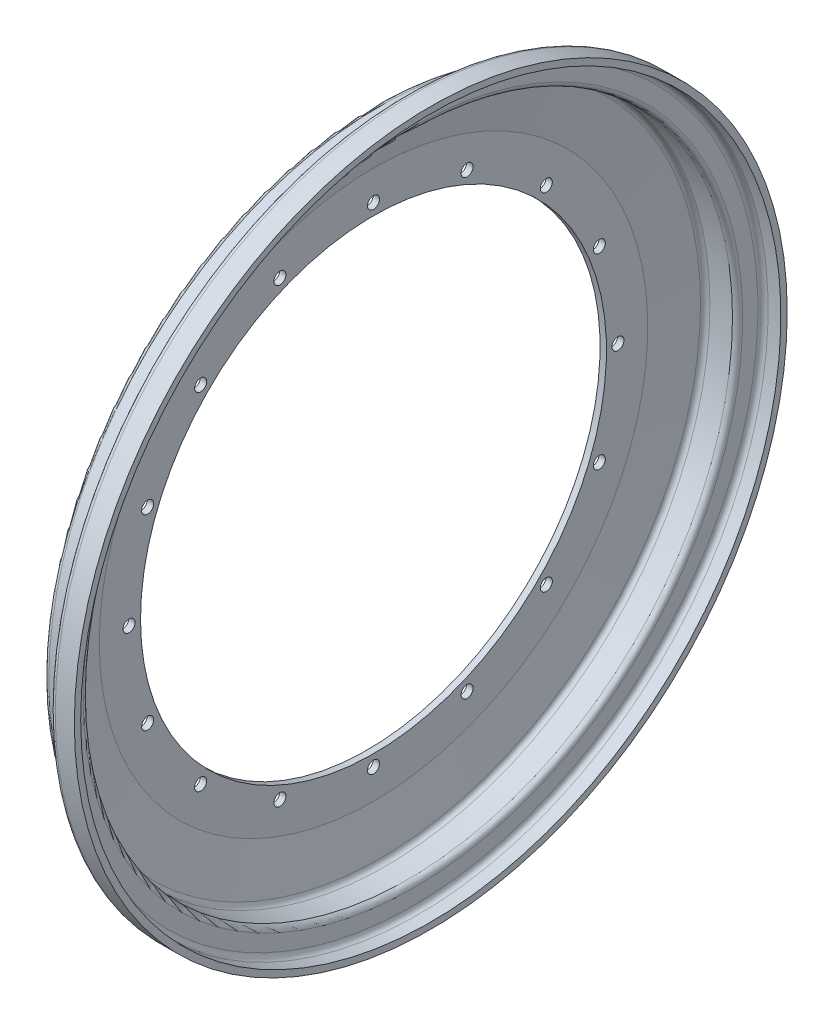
ISO-10303-21;
HEADER;
FILE_DESCRIPTION(('STEP AP214'),'2;1');
FILE_NAME('part.step','',(''),(''),'','','');
FILE_SCHEMA(('AUTOMOTIVE_DESIGN { 1 0 10303 214 1 1 1 1 }'));
ENDSEC;
DATA;
#1=APPLICATION_CONTEXT('core data for automotive mechanical design processes');
#2=APPLICATION_PROTOCOL_DEFINITION('international standard','automotive_design',2000,#1);
#3=PRODUCT_CONTEXT('',#1,'mechanical');
#4=PRODUCT('Part','Part','',(#3));
#5=PRODUCT_RELATED_PRODUCT_CATEGORY('part','',(#4));
#6=PRODUCT_DEFINITION_FORMATION('','',#4);
#7=PRODUCT_DEFINITION_CONTEXT('part definition',#1,'design');
#8=PRODUCT_DEFINITION('design','',#6,#7);
#9=PRODUCT_DEFINITION_SHAPE('','',#8);
#10=(LENGTH_UNIT() NAMED_UNIT(*) SI_UNIT(.MILLI.,.METRE.));
#11=(NAMED_UNIT(*) PLANE_ANGLE_UNIT() SI_UNIT($,.RADIAN.));
#12=(NAMED_UNIT(*) SI_UNIT($,.STERADIAN.) SOLID_ANGLE_UNIT());
#13=UNCERTAINTY_MEASURE_WITH_UNIT(LENGTH_MEASURE(1.E-05),#10,'distance_accuracy_value','');
#14=(GEOMETRIC_REPRESENTATION_CONTEXT(3) GLOBAL_UNCERTAINTY_ASSIGNED_CONTEXT((#13)) GLOBAL_UNIT_ASSIGNED_CONTEXT((#10,
#11,#12)) REPRESENTATION_CONTEXT('',''));
#15=CARTESIAN_POINT('',(0.,0.,0.));
#16=DIRECTION('',(0.,0.,1.));
#17=DIRECTION('',(1.,0.,0.));
#18=AXIS2_PLACEMENT_3D('',#15,#16,#17);
#19=CARTESIAN_POINT('',(3.17499999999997,116.205,0.));
#20=DIRECTION('',(-1.,0.,0.));
#21=DIRECTION('',(0.,0.,1.));
#22=AXIS2_PLACEMENT_3D('',#19,#20,#21);
#23=PLANE('',#22);
#24=CARTESIAN_POINT('',(3.17499999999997,46.656764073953,112.639392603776));
#25=DIRECTION('',(1.,0.,0.));
#26=DIRECTION('',(0.,0.,-1.));
#27=AXIS2_PLACEMENT_3D('',#24,#25,#26);
#28=CIRCLE('',#27,3.);
#29=CARTESIAN_POINT('',(3.17499999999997,46.656764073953,109.639392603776));
#30=VERTEX_POINT('',#29);
#31=EDGE_CURVE('E174',#30,#30,#28,.T.);
#32=ORIENTED_EDGE('',*,*,#31,.F.);
#33=EDGE_LOOP('',(#32));
#34=FACE_BOUND('',#33,.T.);
#35=CARTESIAN_POINT('',(3.17499999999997,-46.6567640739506,112.639392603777));
#36=DIRECTION('',(1.,0.,0.));
#37=DIRECTION('',(0.,0.,-1.));
#38=AXIS2_PLACEMENT_3D('',#35,#36,#37);
#39=CIRCLE('',#38,3.);
#40=CARTESIAN_POINT('',(3.17499999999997,-46.6567640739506,109.639392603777));
#41=VERTEX_POINT('',#40);
#42=EDGE_CURVE('E162',#41,#41,#39,.T.);
#43=ORIENTED_EDGE('',*,*,#42,.F.);
#44=EDGE_LOOP('',(#43));
#45=FACE_BOUND('',#44,.T.);
#46=CARTESIAN_POINT('',(3.17499999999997,-86.2104587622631,86.2104587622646));
#47=DIRECTION('',(1.,0.,0.));
#48=DIRECTION('',(0.,0.,-1.));
#49=AXIS2_PLACEMENT_3D('',#46,#47,#48);
#50=CIRCLE('',#49,3.);
#51=CARTESIAN_POINT('',(3.17499999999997,-86.2104587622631,83.2104587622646));
#52=VERTEX_POINT('',#51);
#53=EDGE_CURVE('E156',#52,#52,#50,.T.);
#54=ORIENTED_EDGE('',*,*,#53,.F.);
#55=EDGE_LOOP('',(#54));
#56=FACE_BOUND('',#55,.T.);
#57=CARTESIAN_POINT('',(3.17499999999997,-112.639392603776,46.6567640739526));
#58=DIRECTION('',(1.,0.,0.));
#59=DIRECTION('',(0.,0.,-1.));
#60=AXIS2_PLACEMENT_3D('',#57,#58,#59);
#61=CIRCLE('',#60,3.);
#62=CARTESIAN_POINT('',(3.17499999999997,-112.639392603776,43.6567640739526));
#63=VERTEX_POINT('',#62);
#64=EDGE_CURVE('E150',#63,#63,#61,.T.);
#65=ORIENTED_EDGE('',*,*,#64,.F.);
#66=EDGE_LOOP('',(#65));
#67=FACE_BOUND('',#66,.T.);
#68=CARTESIAN_POINT('',(3.17499999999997,-121.92,8.51363302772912E-13));
#69=DIRECTION('',(1.,0.,0.));
#70=DIRECTION('',(0.,0.,-1.));
#71=AXIS2_PLACEMENT_3D('',#68,#69,#70);
#72=CIRCLE('',#71,3.);
#73=CARTESIAN_POINT('',(3.17499999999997,-121.92,-2.99999999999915));
#74=VERTEX_POINT('',#73);
#75=EDGE_CURVE('E144',#74,#74,#72,.T.);
#76=ORIENTED_EDGE('',*,*,#75,.F.);
#77=EDGE_LOOP('',(#76));
#78=FACE_BOUND('',#77,.T.);
#79=CARTESIAN_POINT('',(3.17499999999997,-112.639392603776,-46.6567640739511));
#80=DIRECTION('',(1.,0.,0.));
#81=DIRECTION('',(0.,0.,-1.));
#82=AXIS2_PLACEMENT_3D('',#79,#80,#81);
#83=CIRCLE('',#82,3.);
#84=CARTESIAN_POINT('',(3.17499999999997,-112.639392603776,-49.6567640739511));
#85=VERTEX_POINT('',#84);
#86=EDGE_CURVE('E138',#85,#85,#83,.T.);
#87=ORIENTED_EDGE('',*,*,#86,.F.);
#88=EDGE_LOOP('',(#87));
#89=FACE_BOUND('',#88,.T.);
#90=CARTESIAN_POINT('',(3.17499999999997,-86.2104587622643,-86.2104587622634));
#91=DIRECTION('',(1.,0.,0.));
#92=DIRECTION('',(0.,0.,-1.));
#93=AXIS2_PLACEMENT_3D('',#90,#91,#92);
#94=CIRCLE('',#93,3.);
#95=CARTESIAN_POINT('',(3.17499999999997,-86.2104587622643,-89.2104587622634));
#96=VERTEX_POINT('',#95);
#97=EDGE_CURVE('E132',#96,#96,#94,.T.);
#98=ORIENTED_EDGE('',*,*,#97,.F.);
#99=EDGE_LOOP('',(#98));
#100=FACE_BOUND('',#99,.T.);
#101=CARTESIAN_POINT('',(3.17499999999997,0.,0.));
#102=DIRECTION('',(-1.,0.,0.));
#103=DIRECTION('',(0.,0.,1.));
#104=AXIS2_PLACEMENT_3D('',#101,#102,#103);
#105=CIRCLE('',#104,116.205);
#106=CARTESIAN_POINT('',(3.17499999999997,0.,116.205));
#107=VERTEX_POINT('',#106);
#108=EDGE_CURVE('E10',#107,#107,#105,.T.);
#109=ORIENTED_EDGE('',*,*,#108,.T.);
#110=EDGE_LOOP('',(#109));
#111=FACE_BOUND('',#110,.T.);
#112=CARTESIAN_POINT('',(3.17499999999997,0.,0.));
#113=DIRECTION('',(-1.,0.,0.));
#114=DIRECTION('',(0.,0.,1.));
#115=AXIS2_PLACEMENT_3D('',#112,#113,#114);
#116=CIRCLE('',#115,136.779);
#117=CARTESIAN_POINT('',(3.17499999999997,0.,136.779));
#118=VERTEX_POINT('',#117);
#119=EDGE_CURVE('E41',#118,#118,#116,.T.);
#120=ORIENTED_EDGE('',*,*,#119,.F.);
#121=EDGE_LOOP('',(#120));
#122=FACE_BOUND('',#121,.T.);
#123=CARTESIAN_POINT('',(3.17499999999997,121.92,0.));
#124=DIRECTION('',(1.,0.,0.));
#125=DIRECTION('',(0.,0.,-1.));
#126=AXIS2_PLACEMENT_3D('',#123,#124,#125);
#127=CIRCLE('',#126,3.);
#128=CARTESIAN_POINT('',(3.17499999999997,121.92,-3.));
#129=VERTEX_POINT('',#128);
#130=EDGE_CURVE('E96',#129,#129,#127,.T.);
#131=ORIENTED_EDGE('',*,*,#130,.F.);
#132=EDGE_LOOP('',(#131));
#133=FACE_BOUND('',#132,.T.);
#134=CARTESIAN_POINT('',(3.17499999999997,112.639392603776,-46.6567640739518));
#135=DIRECTION('',(1.,0.,0.));
#136=DIRECTION('',(0.,0.,-1.));
#137=AXIS2_PLACEMENT_3D('',#134,#135,#136);
#138=CIRCLE('',#137,3.);
#139=CARTESIAN_POINT('',(3.17499999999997,112.639392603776,-49.6567640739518));
#140=VERTEX_POINT('',#139);
#141=EDGE_CURVE('E102',#140,#140,#138,.T.);
#142=ORIENTED_EDGE('',*,*,#141,.F.);
#143=EDGE_LOOP('',(#142));
#144=FACE_BOUND('',#143,.T.);
#145=CARTESIAN_POINT('',(3.17499999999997,86.2104587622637,-86.210458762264));
#146=DIRECTION('',(1.,0.,0.));
#147=DIRECTION('',(0.,0.,-1.));
#148=AXIS2_PLACEMENT_3D('',#145,#146,#147);
#149=CIRCLE('',#148,3.);
#150=CARTESIAN_POINT('',(3.17499999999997,86.2104587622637,-89.210458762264));
#151=VERTEX_POINT('',#150);
#152=EDGE_CURVE('E108',#151,#151,#149,.T.);
#153=ORIENTED_EDGE('',*,*,#152,.F.);
#154=EDGE_LOOP('',(#153));
#155=FACE_BOUND('',#154,.T.);
#156=CARTESIAN_POINT('',(3.17499999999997,46.6567640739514,-112.639392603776));
#157=DIRECTION('',(1.,0.,0.));
#158=DIRECTION('',(0.,0.,-1.));
#159=AXIS2_PLACEMENT_3D('',#156,#157,#158);
#160=CIRCLE('',#159,3.);
#161=CARTESIAN_POINT('',(3.17499999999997,46.6567640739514,-115.639392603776));
#162=VERTEX_POINT('',#161);
#163=EDGE_CURVE('E114',#162,#162,#160,.T.);
#164=ORIENTED_EDGE('',*,*,#163,.F.);
#165=EDGE_LOOP('',(#164));
#166=FACE_BOUND('',#165,.T.);
#167=CARTESIAN_POINT('',(3.17499999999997,-4.25681651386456E-13,-121.92));
#168=DIRECTION('',(1.,0.,0.));
#169=DIRECTION('',(0.,0.,-1.));
#170=AXIS2_PLACEMENT_3D('',#167,#168,#169);
#171=CIRCLE('',#170,3.);
#172=CARTESIAN_POINT('',(3.17499999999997,-4.25681651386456E-13,-124.92));
#173=VERTEX_POINT('',#172);
#174=EDGE_CURVE('E120',#173,#173,#171,.T.);
#175=ORIENTED_EDGE('',*,*,#174,.F.);
#176=EDGE_LOOP('',(#175));
#177=FACE_BOUND('',#176,.T.);
#178=CARTESIAN_POINT('',(3.17499999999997,-46.6567640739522,-112.639392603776));
#179=DIRECTION('',(1.,0.,0.));
#180=DIRECTION('',(0.,0.,-1.));
#181=AXIS2_PLACEMENT_3D('',#178,#179,#180);
#182=CIRCLE('',#181,3.);
#183=CARTESIAN_POINT('',(3.17499999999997,-46.6567640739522,-115.639392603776));
#184=VERTEX_POINT('',#183);
#185=EDGE_CURVE('E126',#184,#184,#182,.T.);
#186=ORIENTED_EDGE('',*,*,#185,.F.);
#187=EDGE_LOOP('',(#186));
#188=FACE_BOUND('',#187,.T.);
#189=CARTESIAN_POINT('',(3.17499999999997,1.27704495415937E-12,121.92));
#190=DIRECTION('',(1.,0.,0.));
#191=DIRECTION('',(0.,0.,-1.));
#192=AXIS2_PLACEMENT_3D('',#189,#190,#191);
#193=CIRCLE('',#192,3.);
#194=CARTESIAN_POINT('',(3.17499999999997,1.27704495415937E-12,118.92));
#195=VERTEX_POINT('',#194);
#196=EDGE_CURVE('E168',#195,#195,#193,.T.);
#197=ORIENTED_EDGE('',*,*,#196,.F.);
#198=EDGE_LOOP('',(#197));
#199=FACE_BOUND('',#198,.T.);
#200=CARTESIAN_POINT('',(3.17499999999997,86.2104587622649,86.2104587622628));
#201=DIRECTION('',(1.,0.,0.));
#202=DIRECTION('',(0.,0.,-1.));
#203=AXIS2_PLACEMENT_3D('',#200,#201,#202);
#204=CIRCLE('',#203,3.);
#205=CARTESIAN_POINT('',(3.17499999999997,86.2104587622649,83.2104587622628));
#206=VERTEX_POINT('',#205);
#207=EDGE_CURVE('E180',#206,#206,#204,.T.);
#208=ORIENTED_EDGE('',*,*,#207,.F.);
#209=EDGE_LOOP('',(#208));
#210=FACE_BOUND('',#209,.T.);
#211=CARTESIAN_POINT('',(3.17499999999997,112.639392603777,46.6567640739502));
#212=DIRECTION('',(1.,0.,0.));
#213=DIRECTION('',(0.,0.,-1.));
#214=AXIS2_PLACEMENT_3D('',#211,#212,#213);
#215=CIRCLE('',#214,3.);
#216=CARTESIAN_POINT('',(3.17499999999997,112.639392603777,43.6567640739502));
#217=VERTEX_POINT('',#216);
#218=EDGE_CURVE('E186',#217,#217,#215,.T.);
#219=ORIENTED_EDGE('',*,*,#218,.F.);
#220=EDGE_LOOP('',(#219));
#221=FACE_BOUND('',#220,.T.);
#222=ADVANCED_FACE('F34',(#34,#45,#56,#67,#78,#89,#100,#111,#122,#133,#144,#155,#166,#177,#188,
#199,#210,#221),#23,.F.);
#223=CARTESIAN_POINT('',(0.,0.,0.));
#224=DIRECTION('',(-1.,0.,0.));
#225=DIRECTION('',(0.,0.,1.));
#226=AXIS2_PLACEMENT_3D('',#223,#224,#225);
#227=CYLINDRICAL_SURFACE('',#226,116.205);
#228=ORIENTED_EDGE('',*,*,#108,.F.);
#229=EDGE_LOOP('',(#228));
#230=FACE_BOUND('',#229,.T.);
#231=CARTESIAN_POINT('',(0.,0.,0.));
#232=DIRECTION('',(-1.,0.,0.));
#233=DIRECTION('',(0.,0.,1.));
#234=AXIS2_PLACEMENT_3D('',#231,#232,#233);
#235=CIRCLE('',#234,116.205);
#236=CARTESIAN_POINT('',(0.,0.,116.205));
#237=VERTEX_POINT('',#236);
#238=EDGE_CURVE('E93',#237,#237,#235,.T.);
#239=ORIENTED_EDGE('',*,*,#238,.T.);
#240=EDGE_LOOP('',(#239));
#241=FACE_BOUND('',#240,.T.);
#242=ADVANCED_FACE('F36',(#230,#241),#227,.F.);
#243=CARTESIAN_POINT('',(3.17499999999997,0.,0.));
#244=DIRECTION('',(1.,0.,0.));
#245=DIRECTION('',(0.,0.,-1.));
#246=AXIS2_PLACEMENT_3D('',#243,#244,#245);
#247=CONICAL_SURFACE('',#246,136.779,1.42510756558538);
#248=CARTESIAN_POINT('',(6.54604587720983,0.,0.));
#249=DIRECTION('',(-1.,0.,0.));
#250=DIRECTION('',(0.,0.,1.));
#251=AXIS2_PLACEMENT_3D('',#248,#249,#250);
#252=CIRCLE('',#251,159.753741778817);
#253=CARTESIAN_POINT('',(6.54604587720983,0.,159.753741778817));
#254=VERTEX_POINT('',#253);
#255=EDGE_CURVE('E45',#254,#254,#252,.T.);
#256=ORIENTED_EDGE('',*,*,#255,.F.);
#257=EDGE_LOOP('',(#256));
#258=FACE_BOUND('',#257,.T.);
#259=ORIENTED_EDGE('',*,*,#119,.T.);
#260=EDGE_LOOP('',(#259));
#261=FACE_BOUND('',#260,.T.);
#262=ADVANCED_FACE('F208',(#258,#261),#247,.F.);
#263=CARTESIAN_POINT('',(9.05913749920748,0.,0.));
#264=DIRECTION('',(-1.,0.,0.));
#265=DIRECTION('',(0.,0.,1.));
#266=AXIS2_PLACEMENT_3D('',#263,#264,#265);
#267=TOROIDAL_SURFACE('',#266,159.385,2.54);
#268=CARTESIAN_POINT('',(9.05913749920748,0.,0.));
#269=DIRECTION('',(-1.,0.,0.));
#270=DIRECTION('',(0.,0.,1.));
#271=AXIS2_PLACEMENT_3D('',#268,#269,#270);
#272=CIRCLE('',#271,161.925);
#273=CARTESIAN_POINT('',(9.05913749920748,0.,161.925));
#274=VERTEX_POINT('',#273);
#275=EDGE_CURVE('E49',#274,#274,#272,.T.);
#276=ORIENTED_EDGE('',*,*,#275,.F.);
#277=EDGE_LOOP('',(#276));
#278=FACE_BOUND('',#277,.T.);
#279=ORIENTED_EDGE('',*,*,#255,.T.);
#280=EDGE_LOOP('',(#279));
#281=FACE_BOUND('',#280,.T.);
#282=ADVANCED_FACE('F215',(#278,#281),#267,.F.);
#283=CARTESIAN_POINT('',(0.,0.,0.));
#284=DIRECTION('',(-1.,0.,0.));
#285=DIRECTION('',(0.,0.,1.));
#286=AXIS2_PLACEMENT_3D('',#283,#284,#285);
#287=CYLINDRICAL_SURFACE('',#286,161.925);
#288=CARTESIAN_POINT('',(20.32,0.,0.));
#289=DIRECTION('',(-1.,0.,0.));
#290=DIRECTION('',(0.,0.,1.));
#291=AXIS2_PLACEMENT_3D('',#288,#289,#290);
#292=CIRCLE('',#291,161.925);
#293=CARTESIAN_POINT('',(20.32,0.,161.925));
#294=VERTEX_POINT('',#293);
#295=EDGE_CURVE('E54',#294,#294,#292,.T.);
#296=ORIENTED_EDGE('',*,*,#295,.F.);
#297=EDGE_LOOP('',(#296));
#298=FACE_BOUND('',#297,.T.);
#299=ORIENTED_EDGE('',*,*,#275,.T.);
#300=EDGE_LOOP('',(#299));
#301=FACE_BOUND('',#300,.T.);
#302=ADVANCED_FACE('F219',(#298,#301),#287,.F.);
#303=CARTESIAN_POINT('',(20.32,0.,0.));
#304=DIRECTION('',(-1.,0.,0.));
#305=DIRECTION('',(0.,0.,1.));
#306=AXIS2_PLACEMENT_3D('',#303,#304,#305);
#307=TOROIDAL_SURFACE('',#306,164.465,2.53999999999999);
#308=CARTESIAN_POINT('',(22.86,0.,0.));
#309=DIRECTION('',(-1.,0.,0.));
#310=DIRECTION('',(0.,0.,1.));
#311=AXIS2_PLACEMENT_3D('',#308,#309,#310);
#312=CIRCLE('',#311,164.465);
#313=CARTESIAN_POINT('',(22.86,0.,164.465));
#314=VERTEX_POINT('',#313);
#315=EDGE_CURVE('E57',#314,#314,#312,.T.);
#316=ORIENTED_EDGE('',*,*,#315,.F.);
#317=EDGE_LOOP('',(#316));
#318=FACE_BOUND('',#317,.T.);
#319=ORIENTED_EDGE('',*,*,#295,.T.);
#320=EDGE_LOOP('',(#319));
#321=FACE_BOUND('',#320,.T.);
#322=ADVANCED_FACE('F223',(#318,#321),#307,.T.);
#323=CARTESIAN_POINT('',(22.86,172.085,0.));
#324=DIRECTION('',(-1.,0.,0.));
#325=DIRECTION('',(0.,0.,1.));
#326=AXIS2_PLACEMENT_3D('',#323,#324,#325);
#327=PLANE('',#326);
#328=CARTESIAN_POINT('',(22.86,0.,0.));
#329=DIRECTION('',(-1.,0.,0.));
#330=DIRECTION('',(0.,0.,1.));
#331=AXIS2_PLACEMENT_3D('',#328,#329,#330);
#332=CIRCLE('',#331,172.085);
#333=CARTESIAN_POINT('',(22.86,0.,172.085));
#334=VERTEX_POINT('',#333);
#335=EDGE_CURVE('E60',#334,#334,#332,.T.);
#336=ORIENTED_EDGE('',*,*,#335,.F.);
#337=EDGE_LOOP('',(#336));
#338=FACE_BOUND('',#337,.T.);
#339=ORIENTED_EDGE('',*,*,#315,.T.);
#340=EDGE_LOOP('',(#339));
#341=FACE_BOUND('',#340,.T.);
#342=ADVANCED_FACE('F227',(#338,#341),#327,.F.);
#343=CARTESIAN_POINT('',(25.4,0.,0.));
#344=DIRECTION('',(-1.,0.,0.));
#345=DIRECTION('',(0.,0.,1.));
#346=AXIS2_PLACEMENT_3D('',#343,#344,#345);
#347=TOROIDAL_SURFACE('',#346,172.085,2.54000000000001);
#348=CARTESIAN_POINT('',(25.4,0.,0.));
#349=DIRECTION('',(-1.,0.,0.));
#350=DIRECTION('',(0.,0.,1.));
#351=AXIS2_PLACEMENT_3D('',#348,#349,#350);
#352=CIRCLE('',#351,174.625);
#353=CARTESIAN_POINT('',(25.4,0.,174.625));
#354=VERTEX_POINT('',#353);
#355=EDGE_CURVE('E63',#354,#354,#352,.T.);
#356=ORIENTED_EDGE('',*,*,#355,.F.);
#357=EDGE_LOOP('',(#356));
#358=FACE_BOUND('',#357,.T.);
#359=ORIENTED_EDGE('',*,*,#335,.T.);
#360=EDGE_LOOP('',(#359));
#361=FACE_BOUND('',#360,.T.);
#362=ADVANCED_FACE('F231',(#358,#361),#347,.F.);
#363=CARTESIAN_POINT('',(0.,0.,0.));
#364=DIRECTION('',(-1.,0.,0.));
#365=DIRECTION('',(0.,0.,1.));
#366=AXIS2_PLACEMENT_3D('',#363,#364,#365);
#367=CYLINDRICAL_SURFACE('',#366,174.625);
#368=CARTESIAN_POINT('',(31.75,0.,0.));
#369=DIRECTION('',(-1.,0.,0.));
#370=DIRECTION('',(0.,0.,1.));
#371=AXIS2_PLACEMENT_3D('',#368,#369,#370);
#372=CIRCLE('',#371,174.625);
#373=CARTESIAN_POINT('',(31.75,0.,174.625));
#374=VERTEX_POINT('',#373);
#375=EDGE_CURVE('E66',#374,#374,#372,.T.);
#376=ORIENTED_EDGE('',*,*,#375,.F.);
#377=EDGE_LOOP('',(#376));
#378=FACE_BOUND('',#377,.T.);
#379=ORIENTED_EDGE('',*,*,#355,.T.);
#380=EDGE_LOOP('',(#379));
#381=FACE_BOUND('',#380,.T.);
#382=ADVANCED_FACE('F235',(#378,#381),#367,.F.);
#383=CARTESIAN_POINT('',(31.75,177.8,0.));
#384=DIRECTION('',(-1.,0.,0.));
#385=DIRECTION('',(0.,0.,1.));
#386=AXIS2_PLACEMENT_3D('',#383,#384,#385);
#387=PLANE('',#386);
#388=CARTESIAN_POINT('',(31.75,0.,0.));
#389=DIRECTION('',(-1.,0.,0.));
#390=DIRECTION('',(0.,0.,1.));
#391=AXIS2_PLACEMENT_3D('',#388,#389,#390);
#392=CIRCLE('',#391,177.8);
#393=CARTESIAN_POINT('',(31.75,0.,177.8));
#394=VERTEX_POINT('',#393);
#395=EDGE_CURVE('E69',#394,#394,#392,.T.);
#396=ORIENTED_EDGE('',*,*,#395,.F.);
#397=EDGE_LOOP('',(#396));
#398=FACE_BOUND('',#397,.T.);
#399=ORIENTED_EDGE('',*,*,#375,.T.);
#400=EDGE_LOOP('',(#399));
#401=FACE_BOUND('',#400,.T.);
#402=ADVANCED_FACE('F239',(#398,#401),#387,.F.);
#403=CARTESIAN_POINT('',(0.,0.,0.));
#404=DIRECTION('',(-1.,0.,0.));
#405=DIRECTION('',(0.,0.,1.));
#406=AXIS2_PLACEMENT_3D('',#403,#404,#405);
#407=CYLINDRICAL_SURFACE('',#406,177.8);
#408=CARTESIAN_POINT('',(22.225,0.,0.));
#409=DIRECTION('',(-1.,0.,0.));
#410=DIRECTION('',(0.,0.,1.));
#411=AXIS2_PLACEMENT_3D('',#408,#409,#410);
#412=CIRCLE('',#411,177.8);
#413=CARTESIAN_POINT('',(22.225,0.,177.8));
#414=VERTEX_POINT('',#413);
#415=EDGE_CURVE('E72',#414,#414,#412,.T.);
#416=ORIENTED_EDGE('',*,*,#415,.F.);
#417=EDGE_LOOP('',(#416));
#418=FACE_BOUND('',#417,.T.);
#419=ORIENTED_EDGE('',*,*,#395,.T.);
#420=EDGE_LOOP('',(#419));
#421=FACE_BOUND('',#420,.T.);
#422=ADVANCED_FACE('F243',(#418,#421),#407,.T.);
#423=CARTESIAN_POINT('',(22.225,0.,0.));
#424=DIRECTION('',(-1.,0.,0.));
#425=DIRECTION('',(0.,0.,1.));
#426=AXIS2_PLACEMENT_3D('',#423,#424,#425);
#427=TOROIDAL_SURFACE('',#426,175.26,2.53999999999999);
#428=CARTESIAN_POINT('',(19.685,0.,0.));
#429=DIRECTION('',(-1.,0.,0.));
#430=DIRECTION('',(0.,0.,1.));
#431=AXIS2_PLACEMENT_3D('',#428,#429,#430);
#432=CIRCLE('',#431,175.26);
#433=CARTESIAN_POINT('',(19.685,0.,175.26));
#434=VERTEX_POINT('',#433);
#435=EDGE_CURVE('E75',#434,#434,#432,.T.);
#436=ORIENTED_EDGE('',*,*,#435,.F.);
#437=EDGE_LOOP('',(#436));
#438=FACE_BOUND('',#437,.T.);
#439=ORIENTED_EDGE('',*,*,#415,.T.);
#440=EDGE_LOOP('',(#439));
#441=FACE_BOUND('',#440,.T.);
#442=ADVANCED_FACE('F247',(#438,#441),#427,.T.);
#443=CARTESIAN_POINT('',(19.685,167.64,0.));
#444=DIRECTION('',(1.,0.,0.));
#445=DIRECTION('',(0.,0.,-1.));
#446=AXIS2_PLACEMENT_3D('',#443,#444,#445);
#447=PLANE('',#446);
#448=CARTESIAN_POINT('',(19.685,0.,0.));
#449=DIRECTION('',(-1.,0.,0.));
#450=DIRECTION('',(0.,0.,1.));
#451=AXIS2_PLACEMENT_3D('',#448,#449,#450);
#452=CIRCLE('',#451,167.64);
#453=CARTESIAN_POINT('',(19.685,0.,167.64));
#454=VERTEX_POINT('',#453);
#455=EDGE_CURVE('E78',#454,#454,#452,.T.);
#456=ORIENTED_EDGE('',*,*,#455,.F.);
#457=EDGE_LOOP('',(#456));
#458=FACE_BOUND('',#457,.T.);
#459=ORIENTED_EDGE('',*,*,#435,.T.);
#460=EDGE_LOOP('',(#459));
#461=FACE_BOUND('',#460,.T.);
#462=ADVANCED_FACE('F251',(#458,#461),#447,.F.);
#463=CARTESIAN_POINT('',(17.145,0.,0.));
#464=DIRECTION('',(-1.,0.,0.));
#465=DIRECTION('',(0.,0.,1.));
#466=AXIS2_PLACEMENT_3D('',#463,#464,#465);
#467=TOROIDAL_SURFACE('',#466,167.64,2.54000000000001);
#468=CARTESIAN_POINT('',(17.145,0.,0.));
#469=DIRECTION('',(-1.,0.,0.));
#470=DIRECTION('',(0.,0.,1.));
#471=AXIS2_PLACEMENT_3D('',#468,#469,#470);
#472=CIRCLE('',#471,165.1);
#473=CARTESIAN_POINT('',(17.145,0.,165.1));
#474=VERTEX_POINT('',#473);
#475=EDGE_CURVE('E81',#474,#474,#472,.T.);
#476=ORIENTED_EDGE('',*,*,#475,.F.);
#477=EDGE_LOOP('',(#476));
#478=FACE_BOUND('',#477,.T.);
#479=ORIENTED_EDGE('',*,*,#455,.T.);
#480=EDGE_LOOP('',(#479));
#481=FACE_BOUND('',#480,.T.);
#482=ADVANCED_FACE('F255',(#478,#481),#467,.F.);
#483=CARTESIAN_POINT('',(0.,0.,0.));
#484=DIRECTION('',(-1.,0.,0.));
#485=DIRECTION('',(0.,0.,1.));
#486=AXIS2_PLACEMENT_3D('',#483,#484,#485);
#487=CYLINDRICAL_SURFACE('',#486,165.1);
#488=CARTESIAN_POINT('',(6.34999999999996,0.,0.));
#489=DIRECTION('',(-1.,0.,0.));
#490=DIRECTION('',(0.,0.,1.));
#491=AXIS2_PLACEMENT_3D('',#488,#489,#490);
#492=CIRCLE('',#491,165.1);
#493=CARTESIAN_POINT('',(6.34999999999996,0.,165.1));
#494=VERTEX_POINT('',#493);
#495=EDGE_CURVE('E84',#494,#494,#492,.T.);
#496=ORIENTED_EDGE('',*,*,#495,.F.);
#497=EDGE_LOOP('',(#496));
#498=FACE_BOUND('',#497,.T.);
#499=ORIENTED_EDGE('',*,*,#475,.T.);
#500=EDGE_LOOP('',(#499));
#501=FACE_BOUND('',#500,.T.);
#502=ADVANCED_FACE('F259',(#498,#501),#487,.T.);
#503=CARTESIAN_POINT('',(6.34999999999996,0.,0.));
#504=DIRECTION('',(-1.,0.,0.));
#505=DIRECTION('',(0.,0.,1.));
#506=AXIS2_PLACEMENT_3D('',#503,#504,#505);
#507=TOROIDAL_SURFACE('',#506,162.56,2.54000000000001);
#508=CARTESIAN_POINT('',(3.83690837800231,0.,0.));
#509=DIRECTION('',(-1.,0.,0.));
#510=DIRECTION('',(0.,0.,1.));
#511=AXIS2_PLACEMENT_3D('',#508,#509,#510);
#512=CIRCLE('',#511,162.928741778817);
#513=CARTESIAN_POINT('',(3.83690837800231,0.,162.928741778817));
#514=VERTEX_POINT('',#513);
#515=EDGE_CURVE('E87',#514,#514,#512,.T.);
#516=ORIENTED_EDGE('',*,*,#515,.F.);
#517=EDGE_LOOP('',(#516));
#518=FACE_BOUND('',#517,.T.);
#519=ORIENTED_EDGE('',*,*,#495,.T.);
#520=EDGE_LOOP('',(#519));
#521=FACE_BOUND('',#520,.T.);
#522=ADVANCED_FACE('F263',(#518,#521),#507,.T.);
#523=CARTESIAN_POINT('',(3.83690837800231,0.,0.));
#524=DIRECTION('',(1.,0.,0.));
#525=DIRECTION('',(0.,0.,-1.));
#526=AXIS2_PLACEMENT_3D('',#523,#524,#525);
#527=CONICAL_SURFACE('',#526,162.928741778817,1.42510756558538);
#528=CARTESIAN_POINT('',(0.,0.,0.));
#529=DIRECTION('',(-1.,0.,0.));
#530=DIRECTION('',(0.,0.,1.));
#531=AXIS2_PLACEMENT_3D('',#528,#529,#530);
#532=CIRCLE('',#531,136.779);
#533=CARTESIAN_POINT('',(0.,0.,136.779));
#534=VERTEX_POINT('',#533);
#535=EDGE_CURVE('E90',#534,#534,#532,.T.);
#536=ORIENTED_EDGE('',*,*,#535,.F.);
#537=EDGE_LOOP('',(#536));
#538=FACE_BOUND('',#537,.T.);
#539=ORIENTED_EDGE('',*,*,#515,.T.);
#540=EDGE_LOOP('',(#539));
#541=FACE_BOUND('',#540,.T.);
#542=ADVANCED_FACE('F267',(#538,#541),#527,.T.);
#543=CARTESIAN_POINT('',(0.,116.205,0.));
#544=DIRECTION('',(1.,0.,0.));
#545=DIRECTION('',(0.,0.,-1.));
#546=AXIS2_PLACEMENT_3D('',#543,#544,#545);
#547=PLANE('',#546);
#548=CARTESIAN_POINT('',(0.,112.639392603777,46.6567640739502));
#549=DIRECTION('',(1.,0.,0.));
#550=DIRECTION('',(0.,0.,-1.));
#551=AXIS2_PLACEMENT_3D('',#548,#549,#550);
#552=CIRCLE('',#551,3.);
#553=CARTESIAN_POINT('',(0.,112.639392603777,43.6567640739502));
#554=VERTEX_POINT('',#553);
#555=EDGE_CURVE('E189',#554,#554,#552,.T.);
#556=ORIENTED_EDGE('',*,*,#555,.T.);
#557=EDGE_LOOP('',(#556));
#558=FACE_BOUND('',#557,.T.);
#559=CARTESIAN_POINT('',(0.,86.2104587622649,86.2104587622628));
#560=DIRECTION('',(1.,0.,0.));
#561=DIRECTION('',(0.,0.,-1.));
#562=AXIS2_PLACEMENT_3D('',#559,#560,#561);
#563=CIRCLE('',#562,3.);
#564=CARTESIAN_POINT('',(0.,86.2104587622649,83.2104587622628));
#565=VERTEX_POINT('',#564);
#566=EDGE_CURVE('E183',#565,#565,#563,.T.);
#567=ORIENTED_EDGE('',*,*,#566,.T.);
#568=EDGE_LOOP('',(#567));
#569=FACE_BOUND('',#568,.T.);
#570=CARTESIAN_POINT('',(0.,46.656764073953,112.639392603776));
#571=DIRECTION('',(1.,0.,0.));
#572=DIRECTION('',(0.,0.,-1.));
#573=AXIS2_PLACEMENT_3D('',#570,#571,#572);
#574=CIRCLE('',#573,3.);
#575=CARTESIAN_POINT('',(0.,46.656764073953,109.639392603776));
#576=VERTEX_POINT('',#575);
#577=EDGE_CURVE('E177',#576,#576,#574,.T.);
#578=ORIENTED_EDGE('',*,*,#577,.T.);
#579=EDGE_LOOP('',(#578));
#580=FACE_BOUND('',#579,.T.);
#581=CARTESIAN_POINT('',(0.,1.27704495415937E-12,121.92));
#582=DIRECTION('',(1.,0.,0.));
#583=DIRECTION('',(0.,0.,-1.));
#584=AXIS2_PLACEMENT_3D('',#581,#582,#583);
#585=CIRCLE('',#584,3.);
#586=CARTESIAN_POINT('',(0.,1.27704495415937E-12,118.92));
#587=VERTEX_POINT('',#586);
#588=EDGE_CURVE('E171',#587,#587,#585,.T.);
#589=ORIENTED_EDGE('',*,*,#588,.T.);
#590=EDGE_LOOP('',(#589));
#591=FACE_BOUND('',#590,.T.);
#592=CARTESIAN_POINT('',(0.,-46.6567640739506,112.639392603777));
#593=DIRECTION('',(1.,0.,0.));
#594=DIRECTION('',(0.,0.,-1.));
#595=AXIS2_PLACEMENT_3D('',#592,#593,#594);
#596=CIRCLE('',#595,3.);
#597=CARTESIAN_POINT('',(0.,-46.6567640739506,109.639392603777));
#598=VERTEX_POINT('',#597);
#599=EDGE_CURVE('E165',#598,#598,#596,.T.);
#600=ORIENTED_EDGE('',*,*,#599,.T.);
#601=EDGE_LOOP('',(#600));
#602=FACE_BOUND('',#601,.T.);
#603=CARTESIAN_POINT('',(0.,-86.2104587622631,86.2104587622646));
#604=DIRECTION('',(1.,0.,0.));
#605=DIRECTION('',(0.,0.,-1.));
#606=AXIS2_PLACEMENT_3D('',#603,#604,#605);
#607=CIRCLE('',#606,3.);
#608=CARTESIAN_POINT('',(0.,-86.2104587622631,83.2104587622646));
#609=VERTEX_POINT('',#608);
#610=EDGE_CURVE('E159',#609,#609,#607,.T.);
#611=ORIENTED_EDGE('',*,*,#610,.T.);
#612=EDGE_LOOP('',(#611));
#613=FACE_BOUND('',#612,.T.);
#614=CARTESIAN_POINT('',(0.,-112.639392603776,46.6567640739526));
#615=DIRECTION('',(1.,0.,0.));
#616=DIRECTION('',(0.,0.,-1.));
#617=AXIS2_PLACEMENT_3D('',#614,#615,#616);
#618=CIRCLE('',#617,3.);
#619=CARTESIAN_POINT('',(0.,-112.639392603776,43.6567640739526));
#620=VERTEX_POINT('',#619);
#621=EDGE_CURVE('E153',#620,#620,#618,.T.);
#622=ORIENTED_EDGE('',*,*,#621,.T.);
#623=EDGE_LOOP('',(#622));
#624=FACE_BOUND('',#623,.T.);
#625=CARTESIAN_POINT('',(0.,-121.92,8.51363302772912E-13));
#626=DIRECTION('',(1.,0.,0.));
#627=DIRECTION('',(0.,0.,-1.));
#628=AXIS2_PLACEMENT_3D('',#625,#626,#627);
#629=CIRCLE('',#628,3.);
#630=CARTESIAN_POINT('',(0.,-121.92,-2.99999999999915));
#631=VERTEX_POINT('',#630);
#632=EDGE_CURVE('E147',#631,#631,#629,.T.);
#633=ORIENTED_EDGE('',*,*,#632,.T.);
#634=EDGE_LOOP('',(#633));
#635=FACE_BOUND('',#634,.T.);
#636=CARTESIAN_POINT('',(0.,-112.639392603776,-46.6567640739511));
#637=DIRECTION('',(1.,0.,0.));
#638=DIRECTION('',(0.,0.,-1.));
#639=AXIS2_PLACEMENT_3D('',#636,#637,#638);
#640=CIRCLE('',#639,3.);
#641=CARTESIAN_POINT('',(0.,-112.639392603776,-49.6567640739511));
#642=VERTEX_POINT('',#641);
#643=EDGE_CURVE('E141',#642,#642,#640,.T.);
#644=ORIENTED_EDGE('',*,*,#643,.T.);
#645=EDGE_LOOP('',(#644));
#646=FACE_BOUND('',#645,.T.);
#647=CARTESIAN_POINT('',(0.,-86.2104587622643,-86.2104587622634));
#648=DIRECTION('',(1.,0.,0.));
#649=DIRECTION('',(0.,0.,-1.));
#650=AXIS2_PLACEMENT_3D('',#647,#648,#649);
#651=CIRCLE('',#650,3.);
#652=CARTESIAN_POINT('',(0.,-86.2104587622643,-89.2104587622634));
#653=VERTEX_POINT('',#652);
#654=EDGE_CURVE('E135',#653,#653,#651,.T.);
#655=ORIENTED_EDGE('',*,*,#654,.T.);
#656=EDGE_LOOP('',(#655));
#657=FACE_BOUND('',#656,.T.);
#658=CARTESIAN_POINT('',(0.,-46.6567640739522,-112.639392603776));
#659=DIRECTION('',(1.,0.,0.));
#660=DIRECTION('',(0.,0.,-1.));
#661=AXIS2_PLACEMENT_3D('',#658,#659,#660);
#662=CIRCLE('',#661,3.);
#663=CARTESIAN_POINT('',(0.,-46.6567640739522,-115.639392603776));
#664=VERTEX_POINT('',#663);
#665=EDGE_CURVE('E129',#664,#664,#662,.T.);
#666=ORIENTED_EDGE('',*,*,#665,.T.);
#667=EDGE_LOOP('',(#666));
#668=FACE_BOUND('',#667,.T.);
#669=CARTESIAN_POINT('',(0.,-4.25681651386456E-13,-121.92));
#670=DIRECTION('',(1.,0.,0.));
#671=DIRECTION('',(0.,0.,-1.));
#672=AXIS2_PLACEMENT_3D('',#669,#670,#671);
#673=CIRCLE('',#672,3.);
#674=CARTESIAN_POINT('',(0.,-4.25681651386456E-13,-124.92));
#675=VERTEX_POINT('',#674);
#676=EDGE_CURVE('E123',#675,#675,#673,.T.);
#677=ORIENTED_EDGE('',*,*,#676,.T.);
#678=EDGE_LOOP('',(#677));
#679=FACE_BOUND('',#678,.T.);
#680=CARTESIAN_POINT('',(0.,46.6567640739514,-112.639392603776));
#681=DIRECTION('',(1.,0.,0.));
#682=DIRECTION('',(0.,0.,-1.));
#683=AXIS2_PLACEMENT_3D('',#680,#681,#682);
#684=CIRCLE('',#683,3.);
#685=CARTESIAN_POINT('',(0.,46.6567640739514,-115.639392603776));
#686=VERTEX_POINT('',#685);
#687=EDGE_CURVE('E117',#686,#686,#684,.T.);
#688=ORIENTED_EDGE('',*,*,#687,.T.);
#689=EDGE_LOOP('',(#688));
#690=FACE_BOUND('',#689,.T.);
#691=CARTESIAN_POINT('',(0.,86.2104587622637,-86.210458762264));
#692=DIRECTION('',(1.,0.,0.));
#693=DIRECTION('',(0.,0.,-1.));
#694=AXIS2_PLACEMENT_3D('',#691,#692,#693);
#695=CIRCLE('',#694,3.);
#696=CARTESIAN_POINT('',(0.,86.2104587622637,-89.210458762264));
#697=VERTEX_POINT('',#696);
#698=EDGE_CURVE('E111',#697,#697,#695,.T.);
#699=ORIENTED_EDGE('',*,*,#698,.T.);
#700=EDGE_LOOP('',(#699));
#701=FACE_BOUND('',#700,.T.);
#702=CARTESIAN_POINT('',(0.,112.639392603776,-46.6567640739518));
#703=DIRECTION('',(1.,0.,0.));
#704=DIRECTION('',(0.,0.,-1.));
#705=AXIS2_PLACEMENT_3D('',#702,#703,#704);
#706=CIRCLE('',#705,3.);
#707=CARTESIAN_POINT('',(0.,112.639392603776,-49.6567640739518));
#708=VERTEX_POINT('',#707);
#709=EDGE_CURVE('E105',#708,#708,#706,.T.);
#710=ORIENTED_EDGE('',*,*,#709,.T.);
#711=EDGE_LOOP('',(#710));
#712=FACE_BOUND('',#711,.T.);
#713=CARTESIAN_POINT('',(0.,121.92,0.));
#714=DIRECTION('',(1.,0.,0.));
#715=DIRECTION('',(0.,0.,-1.));
#716=AXIS2_PLACEMENT_3D('',#713,#714,#715);
#717=CIRCLE('',#716,3.);
#718=CARTESIAN_POINT('',(0.,121.92,-3.));
#719=VERTEX_POINT('',#718);
#720=EDGE_CURVE('E99',#719,#719,#717,.T.);
#721=ORIENTED_EDGE('',*,*,#720,.T.);
#722=EDGE_LOOP('',(#721));
#723=FACE_BOUND('',#722,.T.);
#724=ORIENTED_EDGE('',*,*,#238,.F.);
#725=EDGE_LOOP('',(#724));
#726=FACE_BOUND('',#725,.T.);
#727=ORIENTED_EDGE('',*,*,#535,.T.);
#728=EDGE_LOOP('',(#727));
#729=FACE_BOUND('',#728,.T.);
#730=ADVANCED_FACE('F193',(#558,#569,#580,#591,#602,#613,#624,#635,#646,#657,#668,#679,#690,
#701,#712,#723,#726,#729),#547,.F.);
#731=CARTESIAN_POINT('',(3.17499999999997,121.92,0.));
#732=DIRECTION('',(1.,0.,0.));
#733=DIRECTION('',(0.,0.,-1.));
#734=AXIS2_PLACEMENT_3D('',#731,#732,#733);
#735=CYLINDRICAL_SURFACE('',#734,3.);
#736=ORIENTED_EDGE('',*,*,#720,.F.);
#737=EDGE_LOOP('',(#736));
#738=FACE_BOUND('',#737,.T.);
#739=ORIENTED_EDGE('',*,*,#130,.T.);
#740=EDGE_LOOP('',(#739));
#741=FACE_BOUND('',#740,.T.);
#742=ADVANCED_FACE('F274',(#738,#741),#735,.F.);
#743=CARTESIAN_POINT('',(3.17499999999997,112.639392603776,-46.6567640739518));
#744=DIRECTION('',(1.,0.,0.));
#745=DIRECTION('',(0.,0.,-1.));
#746=AXIS2_PLACEMENT_3D('',#743,#744,#745);
#747=CYLINDRICAL_SURFACE('',#746,3.);
#748=ORIENTED_EDGE('',*,*,#709,.F.);
#749=EDGE_LOOP('',(#748));
#750=FACE_BOUND('',#749,.T.);
#751=ORIENTED_EDGE('',*,*,#141,.T.);
#752=EDGE_LOOP('',(#751));
#753=FACE_BOUND('',#752,.T.);
#754=ADVANCED_FACE('F277',(#750,#753),#747,.F.);
#755=CARTESIAN_POINT('',(3.17499999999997,86.2104587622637,-86.210458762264));
#756=DIRECTION('',(1.,0.,0.));
#757=DIRECTION('',(0.,0.,-1.));
#758=AXIS2_PLACEMENT_3D('',#755,#756,#757);
#759=CYLINDRICAL_SURFACE('',#758,3.);
#760=ORIENTED_EDGE('',*,*,#698,.F.);
#761=EDGE_LOOP('',(#760));
#762=FACE_BOUND('',#761,.T.);
#763=ORIENTED_EDGE('',*,*,#152,.T.);
#764=EDGE_LOOP('',(#763));
#765=FACE_BOUND('',#764,.T.);
#766=ADVANCED_FACE('F281',(#762,#765),#759,.F.);
#767=CARTESIAN_POINT('',(3.17499999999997,46.6567640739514,-112.639392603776));
#768=DIRECTION('',(1.,0.,0.));
#769=DIRECTION('',(0.,0.,-1.));
#770=AXIS2_PLACEMENT_3D('',#767,#768,#769);
#771=CYLINDRICAL_SURFACE('',#770,3.);
#772=ORIENTED_EDGE('',*,*,#687,.F.);
#773=EDGE_LOOP('',(#772));
#774=FACE_BOUND('',#773,.T.);
#775=ORIENTED_EDGE('',*,*,#163,.T.);
#776=EDGE_LOOP('',(#775));
#777=FACE_BOUND('',#776,.T.);
#778=ADVANCED_FACE('F285',(#774,#777),#771,.F.);
#779=CARTESIAN_POINT('',(3.17499999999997,-4.25681651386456E-13,-121.92));
#780=DIRECTION('',(1.,0.,0.));
#781=DIRECTION('',(0.,0.,-1.));
#782=AXIS2_PLACEMENT_3D('',#779,#780,#781);
#783=CYLINDRICAL_SURFACE('',#782,3.);
#784=ORIENTED_EDGE('',*,*,#676,.F.);
#785=EDGE_LOOP('',(#784));
#786=FACE_BOUND('',#785,.T.);
#787=ORIENTED_EDGE('',*,*,#174,.T.);
#788=EDGE_LOOP('',(#787));
#789=FACE_BOUND('',#788,.T.);
#790=ADVANCED_FACE('F289',(#786,#789),#783,.F.);
#791=CARTESIAN_POINT('',(3.17499999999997,-46.6567640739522,-112.639392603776));
#792=DIRECTION('',(1.,0.,0.));
#793=DIRECTION('',(0.,0.,-1.));
#794=AXIS2_PLACEMENT_3D('',#791,#792,#793);
#795=CYLINDRICAL_SURFACE('',#794,3.);
#796=ORIENTED_EDGE('',*,*,#665,.F.);
#797=EDGE_LOOP('',(#796));
#798=FACE_BOUND('',#797,.T.);
#799=ORIENTED_EDGE('',*,*,#185,.T.);
#800=EDGE_LOOP('',(#799));
#801=FACE_BOUND('',#800,.T.);
#802=ADVANCED_FACE('F293',(#798,#801),#795,.F.);
#803=CARTESIAN_POINT('',(3.17499999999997,-86.2104587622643,-86.2104587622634));
#804=DIRECTION('',(1.,0.,0.));
#805=DIRECTION('',(0.,0.,-1.));
#806=AXIS2_PLACEMENT_3D('',#803,#804,#805);
#807=CYLINDRICAL_SURFACE('',#806,3.);
#808=ORIENTED_EDGE('',*,*,#654,.F.);
#809=EDGE_LOOP('',(#808));
#810=FACE_BOUND('',#809,.T.);
#811=ORIENTED_EDGE('',*,*,#97,.T.);
#812=EDGE_LOOP('',(#811));
#813=FACE_BOUND('',#812,.T.);
#814=ADVANCED_FACE('F297',(#810,#813),#807,.F.);
#815=CARTESIAN_POINT('',(3.17499999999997,-112.639392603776,-46.6567640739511));
#816=DIRECTION('',(1.,0.,0.));
#817=DIRECTION('',(0.,0.,-1.));
#818=AXIS2_PLACEMENT_3D('',#815,#816,#817);
#819=CYLINDRICAL_SURFACE('',#818,3.);
#820=ORIENTED_EDGE('',*,*,#643,.F.);
#821=EDGE_LOOP('',(#820));
#822=FACE_BOUND('',#821,.T.);
#823=ORIENTED_EDGE('',*,*,#86,.T.);
#824=EDGE_LOOP('',(#823));
#825=FACE_BOUND('',#824,.T.);
#826=ADVANCED_FACE('F301',(#822,#825),#819,.F.);
#827=CARTESIAN_POINT('',(3.17499999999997,-121.92,8.51363302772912E-13));
#828=DIRECTION('',(1.,0.,0.));
#829=DIRECTION('',(0.,0.,-1.));
#830=AXIS2_PLACEMENT_3D('',#827,#828,#829);
#831=CYLINDRICAL_SURFACE('',#830,3.);
#832=ORIENTED_EDGE('',*,*,#632,.F.);
#833=EDGE_LOOP('',(#832));
#834=FACE_BOUND('',#833,.T.);
#835=ORIENTED_EDGE('',*,*,#75,.T.);
#836=EDGE_LOOP('',(#835));
#837=FACE_BOUND('',#836,.T.);
#838=ADVANCED_FACE('F305',(#834,#837),#831,.F.);
#839=CARTESIAN_POINT('',(3.17499999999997,-112.639392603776,46.6567640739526));
#840=DIRECTION('',(1.,0.,0.));
#841=DIRECTION('',(0.,0.,-1.));
#842=AXIS2_PLACEMENT_3D('',#839,#840,#841);
#843=CYLINDRICAL_SURFACE('',#842,3.);
#844=ORIENTED_EDGE('',*,*,#621,.F.);
#845=EDGE_LOOP('',(#844));
#846=FACE_BOUND('',#845,.T.);
#847=ORIENTED_EDGE('',*,*,#64,.T.);
#848=EDGE_LOOP('',(#847));
#849=FACE_BOUND('',#848,.T.);
#850=ADVANCED_FACE('F309',(#846,#849),#843,.F.);
#851=CARTESIAN_POINT('',(3.17499999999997,-86.2104587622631,86.2104587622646));
#852=DIRECTION('',(1.,0.,0.));
#853=DIRECTION('',(0.,0.,-1.));
#854=AXIS2_PLACEMENT_3D('',#851,#852,#853);
#855=CYLINDRICAL_SURFACE('',#854,3.);
#856=ORIENTED_EDGE('',*,*,#610,.F.);
#857=EDGE_LOOP('',(#856));
#858=FACE_BOUND('',#857,.T.);
#859=ORIENTED_EDGE('',*,*,#53,.T.);
#860=EDGE_LOOP('',(#859));
#861=FACE_BOUND('',#860,.T.);
#862=ADVANCED_FACE('F313',(#858,#861),#855,.F.);
#863=CARTESIAN_POINT('',(3.17499999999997,-46.6567640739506,112.639392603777));
#864=DIRECTION('',(1.,0.,0.));
#865=DIRECTION('',(0.,0.,-1.));
#866=AXIS2_PLACEMENT_3D('',#863,#864,#865);
#867=CYLINDRICAL_SURFACE('',#866,3.);
#868=ORIENTED_EDGE('',*,*,#599,.F.);
#869=EDGE_LOOP('',(#868));
#870=FACE_BOUND('',#869,.T.);
#871=ORIENTED_EDGE('',*,*,#42,.T.);
#872=EDGE_LOOP('',(#871));
#873=FACE_BOUND('',#872,.T.);
#874=ADVANCED_FACE('F317',(#870,#873),#867,.F.);
#875=CARTESIAN_POINT('',(3.17499999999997,1.27704495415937E-12,121.92));
#876=DIRECTION('',(1.,0.,0.));
#877=DIRECTION('',(0.,0.,-1.));
#878=AXIS2_PLACEMENT_3D('',#875,#876,#877);
#879=CYLINDRICAL_SURFACE('',#878,3.);
#880=ORIENTED_EDGE('',*,*,#588,.F.);
#881=EDGE_LOOP('',(#880));
#882=FACE_BOUND('',#881,.T.);
#883=ORIENTED_EDGE('',*,*,#196,.T.);
#884=EDGE_LOOP('',(#883));
#885=FACE_BOUND('',#884,.T.);
#886=ADVANCED_FACE('F321',(#882,#885),#879,.F.);
#887=CARTESIAN_POINT('',(3.17499999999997,46.656764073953,112.639392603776));
#888=DIRECTION('',(1.,0.,0.));
#889=DIRECTION('',(0.,0.,-1.));
#890=AXIS2_PLACEMENT_3D('',#887,#888,#889);
#891=CYLINDRICAL_SURFACE('',#890,3.);
#892=ORIENTED_EDGE('',*,*,#577,.F.);
#893=EDGE_LOOP('',(#892));
#894=FACE_BOUND('',#893,.T.);
#895=ORIENTED_EDGE('',*,*,#31,.T.);
#896=EDGE_LOOP('',(#895));
#897=FACE_BOUND('',#896,.T.);
#898=ADVANCED_FACE('F325',(#894,#897),#891,.F.);
#899=CARTESIAN_POINT('',(3.17499999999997,86.2104587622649,86.2104587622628));
#900=DIRECTION('',(1.,0.,0.));
#901=DIRECTION('',(0.,0.,-1.));
#902=AXIS2_PLACEMENT_3D('',#899,#900,#901);
#903=CYLINDRICAL_SURFACE('',#902,3.);
#904=ORIENTED_EDGE('',*,*,#566,.F.);
#905=EDGE_LOOP('',(#904));
#906=FACE_BOUND('',#905,.T.);
#907=ORIENTED_EDGE('',*,*,#207,.T.);
#908=EDGE_LOOP('',(#907));
#909=FACE_BOUND('',#908,.T.);
#910=ADVANCED_FACE('F199',(#906,#909),#903,.F.);
#911=CARTESIAN_POINT('',(3.17499999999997,112.639392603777,46.6567640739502));
#912=DIRECTION('',(1.,0.,0.));
#913=DIRECTION('',(0.,0.,-1.));
#914=AXIS2_PLACEMENT_3D('',#911,#912,#913);
#915=CYLINDRICAL_SURFACE('',#914,3.);
#916=ORIENTED_EDGE('',*,*,#555,.F.);
#917=EDGE_LOOP('',(#916));
#918=FACE_BOUND('',#917,.T.);
#919=ORIENTED_EDGE('',*,*,#218,.T.);
#920=EDGE_LOOP('',(#919));
#921=FACE_BOUND('',#920,.T.);
#922=ADVANCED_FACE('F196',(#918,#921),#915,.F.);
#923=CLOSED_SHELL('',(#222,#242,#262,#282,#302,#322,#342,#362,#382,#402,#422,#442,#462,#482,
#502,#522,#542,#730,#742,#754,#766,#778,#790,#802,#814,#826,#838,#850,#862,#874,#886,#898,#910,#922));
#924=MANIFOLD_SOLID_BREP('B2',#923);
#925=ADVANCED_BREP_SHAPE_REPRESENTATION('',(#18,#924),#14);
#926=SHAPE_DEFINITION_REPRESENTATION(#9,#925);
ENDSEC;
END-ISO-10303-21;
